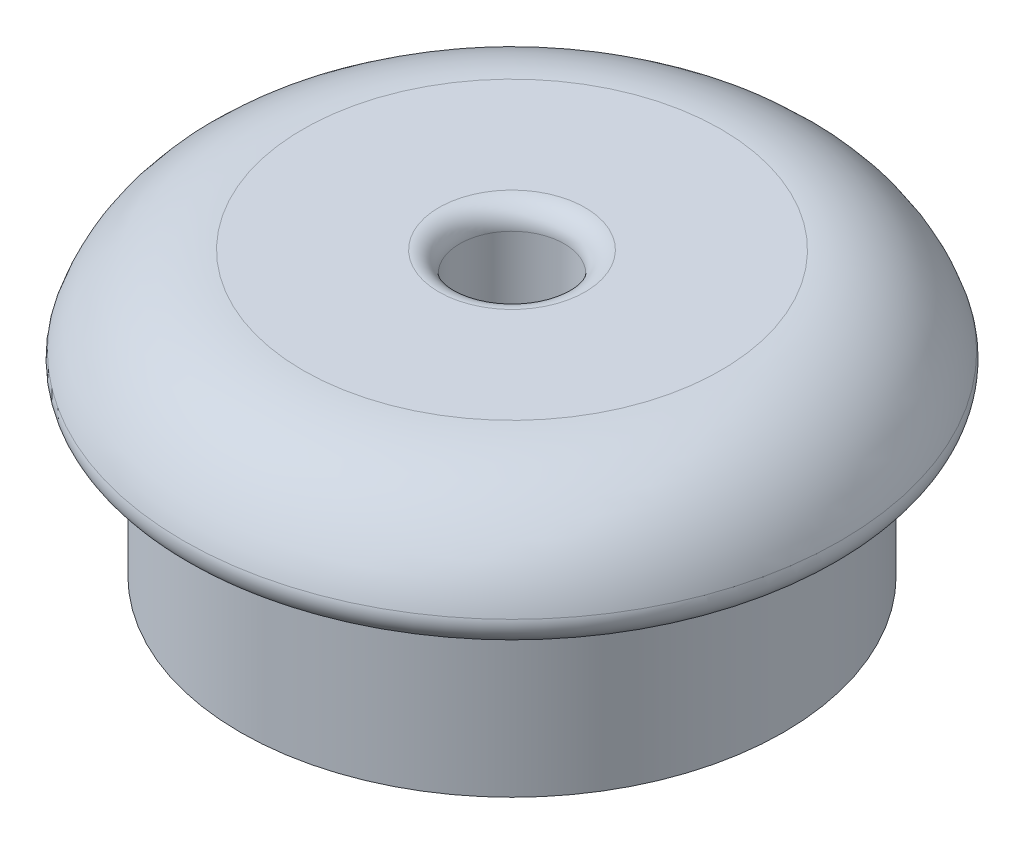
from build123d import *

# Parameters (mm, degrees)
SKETCH2_R          = 6.604
SHAFT_DEPTH        = 4.064
SHAFT_START        = -4.064
SKETCH3_R          = 5.334
SKETCH3_R_2        = 2.54
SHAFT_GROOVE_DEPTH = 4.064
SKETCH4_R          = 1.27
TOP_HOLE_DEPTH     = 5.588
FILLET1_R          = 0.508


with BuildPart() as part:
    # Sketch1 → Button Top (revolve)
    with BuildSketch(Plane.XY, mode=Mode.PRIVATE) as button_top_sk:
        with BuildLine():
            Line((0, 0), (7.503005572, 0))
            ThreePointArc((7.503005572, 0), (7.912568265, 0.207463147), (7.987606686, 0.6604))
            ThreePointArc((7.987606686, 0.6604), (6.883221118, 2.203376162), (5.08, 2.794))
            Line((5.08, 2.794), (0, 2.794))
            Line((0, 2.794), (0, 0))
        make_face()
    revolve(button_top_sk.sketch.rotate(Axis((0, 0, 0), (0, 1, 0)), 90), axis=Axis((0, 0, 0), (0, 1, 0)))

    # Sketch2 → Shaft (add)
    with BuildSketch(Plane.XZ):
        with Locations(Location((0, 0, 0), (0, 0, 270))):
            Circle(SKETCH2_R)
    extrude(amount=SHAFT_DEPTH)

    # Sketch3 → Shaft Groove (cut)
    with BuildSketch(Plane.XZ.offset(4.064).offset(SHAFT_START)):
        with Locations(Location((0, 0, 0), (0, 0, 270))):
            Circle(SKETCH3_R)
        with Locations(Location((0, 0, 0), (0, 0, 270))):
            Circle(SKETCH3_R_2, mode=Mode.SUBTRACT)
    extrude(amount=SHAFT_GROOVE_DEPTH, mode=Mode.SUBTRACT)

    # Sketch4 → Top Hole (cut)
    with BuildSketch(Plane(origin=(0, 2.794, 0), x_dir=(-1, 0, 0), z_dir=(0, 1, 0))):
        with Locations(Location((0, 0, 0), (0, 0, 90))):
            Circle(SKETCH4_R)
    extrude(amount=-TOP_HOLE_DEPTH, mode=Mode.SUBTRACT)

    # Fillet1
    fillet1_edges = [part.edges().sort_by_distance(p)[0] for p in [
        (0, 0, 6.604),
        (0, 0, 2.54),
        (0, 0, 5.334),
        (0, 2.794, -1.27),
        (0, -2.794, -1.27),
    ]]
    fillet(fillet1_edges, radius=FILLET1_R)


solid = part.part
